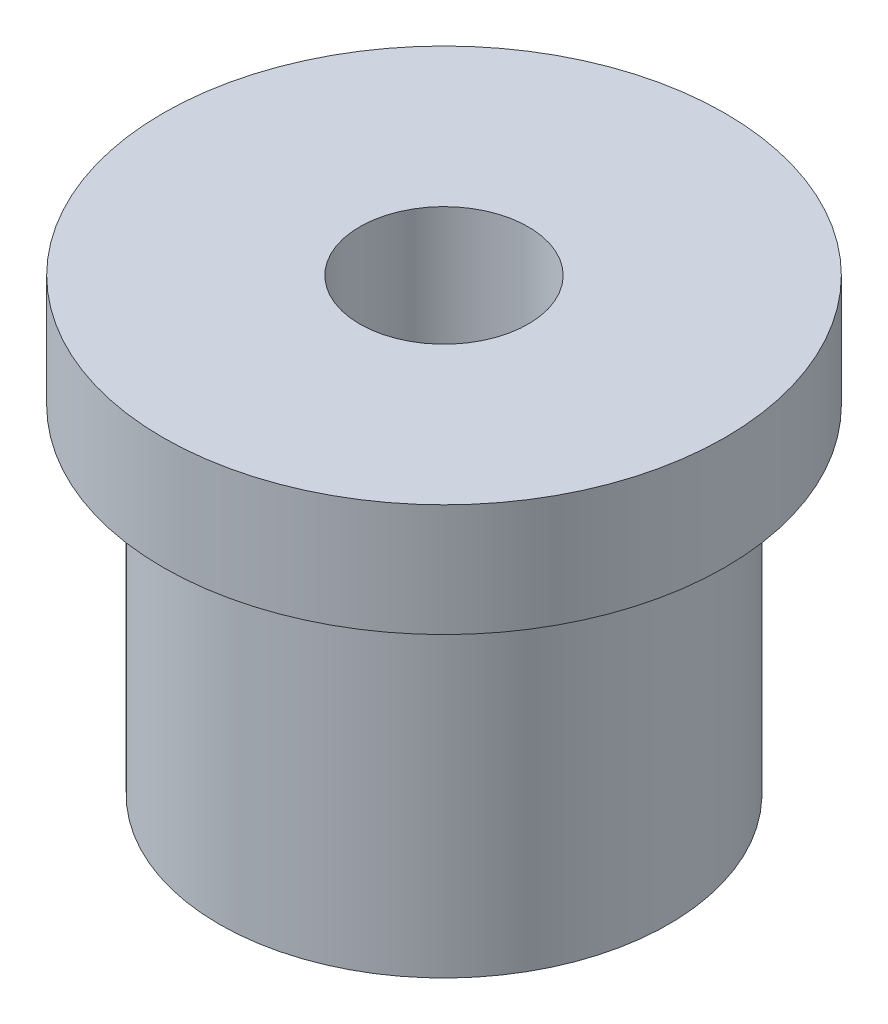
ISO-10303-21;
HEADER;
FILE_DESCRIPTION(('STEP AP214'),'2;1');
FILE_NAME('part.step','',(''),(''),'','','');
FILE_SCHEMA(('AUTOMOTIVE_DESIGN { 1 0 10303 214 1 1 1 1 }'));
ENDSEC;
DATA;
#1=APPLICATION_CONTEXT('core data for automotive mechanical design processes');
#2=APPLICATION_PROTOCOL_DEFINITION('international standard','automotive_design',2000,#1);
#3=PRODUCT_CONTEXT('',#1,'mechanical');
#4=PRODUCT('Part','Part','',(#3));
#5=PRODUCT_RELATED_PRODUCT_CATEGORY('part','',(#4));
#6=PRODUCT_DEFINITION_FORMATION('','',#4);
#7=PRODUCT_DEFINITION_CONTEXT('part definition',#1,'design');
#8=PRODUCT_DEFINITION('design','',#6,#7);
#9=PRODUCT_DEFINITION_SHAPE('','',#8);
#10=(LENGTH_UNIT() NAMED_UNIT(*) SI_UNIT(.MILLI.,.METRE.));
#11=(NAMED_UNIT(*) PLANE_ANGLE_UNIT() SI_UNIT($,.RADIAN.));
#12=(NAMED_UNIT(*) SI_UNIT($,.STERADIAN.) SOLID_ANGLE_UNIT());
#13=UNCERTAINTY_MEASURE_WITH_UNIT(LENGTH_MEASURE(1.E-05),#10,'distance_accuracy_value','');
#14=(GEOMETRIC_REPRESENTATION_CONTEXT(3) GLOBAL_UNCERTAINTY_ASSIGNED_CONTEXT((#13)) GLOBAL_UNIT_ASSIGNED_CONTEXT((#10,
#11,#12)) REPRESENTATION_CONTEXT('',''));
#15=CARTESIAN_POINT('',(0.,0.,0.));
#16=DIRECTION('',(0.,0.,1.));
#17=DIRECTION('',(1.,0.,0.));
#18=AXIS2_PLACEMENT_3D('',#15,#16,#17);
#19=CARTESIAN_POINT('',(0.,8.,0.));
#20=DIRECTION('',(0.,-1.,0.));
#21=DIRECTION('',(0.,0.,-1.));
#22=AXIS2_PLACEMENT_3D('',#19,#20,#21);
#23=CYLINDRICAL_SURFACE('',#22,5.);
#24=CARTESIAN_POINT('',(0.,6.,0.));
#25=DIRECTION('',(0.,-1.,0.));
#26=DIRECTION('',(0.,0.,-1.));
#27=AXIS2_PLACEMENT_3D('',#24,#25,#26);
#28=CIRCLE('',#27,5.);
#29=CARTESIAN_POINT('',(0.,6.,-5.));
#30=VERTEX_POINT('',#29);
#31=EDGE_CURVE('E47',#30,#30,#28,.T.);
#32=ORIENTED_EDGE('',*,*,#31,.F.);
#33=EDGE_LOOP('',(#32));
#34=FACE_BOUND('',#33,.T.);
#35=CARTESIAN_POINT('',(0.,8.,0.));
#36=DIRECTION('',(0.,-1.,0.));
#37=DIRECTION('',(0.,0.,-1.));
#38=AXIS2_PLACEMENT_3D('',#35,#36,#37);
#39=CIRCLE('',#38,5.);
#40=CARTESIAN_POINT('',(0.,8.,-5.));
#41=VERTEX_POINT('',#40);
#42=EDGE_CURVE('E10',#41,#41,#39,.T.);
#43=ORIENTED_EDGE('',*,*,#42,.T.);
#44=EDGE_LOOP('',(#43));
#45=FACE_BOUND('',#44,.T.);
#46=ADVANCED_FACE('F33',(#34,#45),#23,.T.);
#47=CARTESIAN_POINT('',(-5.,8.,0.));
#48=DIRECTION('',(0.,-1.,0.));
#49=DIRECTION('',(0.,0.,-1.));
#50=AXIS2_PLACEMENT_3D('',#47,#48,#49);
#51=PLANE('',#50);
#52=CARTESIAN_POINT('',(0.,8.,0.));
#53=DIRECTION('',(0.,1.,0.));
#54=DIRECTION('',(0.,0.,1.));
#55=AXIS2_PLACEMENT_3D('',#52,#53,#54);
#56=CIRCLE('',#55,1.5);
#57=CARTESIAN_POINT('',(0.,8.,1.5));
#58=VERTEX_POINT('',#57);
#59=EDGE_CURVE('E55',#58,#58,#56,.T.);
#60=ORIENTED_EDGE('',*,*,#59,.F.);
#61=EDGE_LOOP('',(#60));
#62=FACE_BOUND('',#61,.T.);
#63=ORIENTED_EDGE('',*,*,#42,.F.);
#64=EDGE_LOOP('',(#63));
#65=FACE_BOUND('',#64,.T.);
#66=ADVANCED_FACE('F62',(#62,#65),#51,.F.);
#67=CARTESIAN_POINT('',(0.,0.,0.));
#68=DIRECTION('',(0.,1.,0.));
#69=DIRECTION('',(0.,0.,1.));
#70=AXIS2_PLACEMENT_3D('',#67,#68,#69);
#71=PLANE('',#70);
#72=CARTESIAN_POINT('',(0.,0.,0.));
#73=DIRECTION('',(0.,1.,0.));
#74=DIRECTION('',(0.,0.,1.));
#75=AXIS2_PLACEMENT_3D('',#72,#73,#74);
#76=CIRCLE('',#75,1.5);
#77=CARTESIAN_POINT('',(0.,0.,1.5));
#78=VERTEX_POINT('',#77);
#79=EDGE_CURVE('E52',#78,#78,#76,.F.);
#80=ORIENTED_EDGE('',*,*,#79,.F.);
#81=EDGE_LOOP('',(#80));
#82=FACE_BOUND('',#81,.T.);
#83=CARTESIAN_POINT('',(0.,0.,0.));
#84=DIRECTION('',(0.,-1.,0.));
#85=DIRECTION('',(0.,0.,-1.));
#86=AXIS2_PLACEMENT_3D('',#83,#84,#85);
#87=CIRCLE('',#86,4.);
#88=CARTESIAN_POINT('',(0.,0.,-4.));
#89=VERTEX_POINT('',#88);
#90=EDGE_CURVE('E39',#89,#89,#87,.T.);
#91=ORIENTED_EDGE('',*,*,#90,.T.);
#92=EDGE_LOOP('',(#91));
#93=FACE_BOUND('',#92,.T.);
#94=ADVANCED_FACE('F65',(#82,#93),#71,.F.);
#95=CARTESIAN_POINT('',(0.,8.,0.));
#96=DIRECTION('',(0.,-1.,0.));
#97=DIRECTION('',(0.,0.,-1.));
#98=AXIS2_PLACEMENT_3D('',#95,#96,#97);
#99=CYLINDRICAL_SURFACE('',#98,4.);
#100=ORIENTED_EDGE('',*,*,#90,.F.);
#101=EDGE_LOOP('',(#100));
#102=FACE_BOUND('',#101,.T.);
#103=CARTESIAN_POINT('',(0.,6.,0.));
#104=DIRECTION('',(0.,-1.,0.));
#105=DIRECTION('',(0.,0.,-1.));
#106=AXIS2_PLACEMENT_3D('',#103,#104,#105);
#107=CIRCLE('',#106,4.);
#108=CARTESIAN_POINT('',(0.,6.,-4.));
#109=VERTEX_POINT('',#108);
#110=EDGE_CURVE('E43',#109,#109,#107,.T.);
#111=ORIENTED_EDGE('',*,*,#110,.T.);
#112=EDGE_LOOP('',(#111));
#113=FACE_BOUND('',#112,.T.);
#114=ADVANCED_FACE('F70',(#102,#113),#99,.T.);
#115=CARTESIAN_POINT('',(-4.,6.,0.));
#116=DIRECTION('',(0.,1.,0.));
#117=DIRECTION('',(0.,0.,1.));
#118=AXIS2_PLACEMENT_3D('',#115,#116,#117);
#119=PLANE('',#118);
#120=ORIENTED_EDGE('',*,*,#110,.F.);
#121=EDGE_LOOP('',(#120));
#122=FACE_BOUND('',#121,.T.);
#123=ORIENTED_EDGE('',*,*,#31,.T.);
#124=EDGE_LOOP('',(#123));
#125=FACE_BOUND('',#124,.T.);
#126=ADVANCED_FACE('F77',(#122,#125),#119,.F.);
#127=CARTESIAN_POINT('',(0.,-0.001000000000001,0.));
#128=DIRECTION('',(0.,1.,0.));
#129=DIRECTION('',(0.,0.,1.));
#130=AXIS2_PLACEMENT_3D('',#127,#128,#129);
#131=CYLINDRICAL_SURFACE('',#130,1.5);
#132=ORIENTED_EDGE('',*,*,#59,.T.);
#133=EDGE_LOOP('',(#132));
#134=FACE_BOUND('',#133,.T.);
#135=ORIENTED_EDGE('',*,*,#79,.T.);
#136=EDGE_LOOP('',(#135));
#137=FACE_BOUND('',#136,.T.);
#138=ADVANCED_FACE('F59',(#134,#137),#131,.F.);
#139=CLOSED_SHELL('',(#46,#66,#94,#114,#126,#138));
#140=MANIFOLD_SOLID_BREP('B2',#139);
#141=ADVANCED_BREP_SHAPE_REPRESENTATION('',(#18,#140),#14);
#142=SHAPE_DEFINITION_REPRESENTATION(#9,#141);
ENDSEC;
END-ISO-10303-21;
